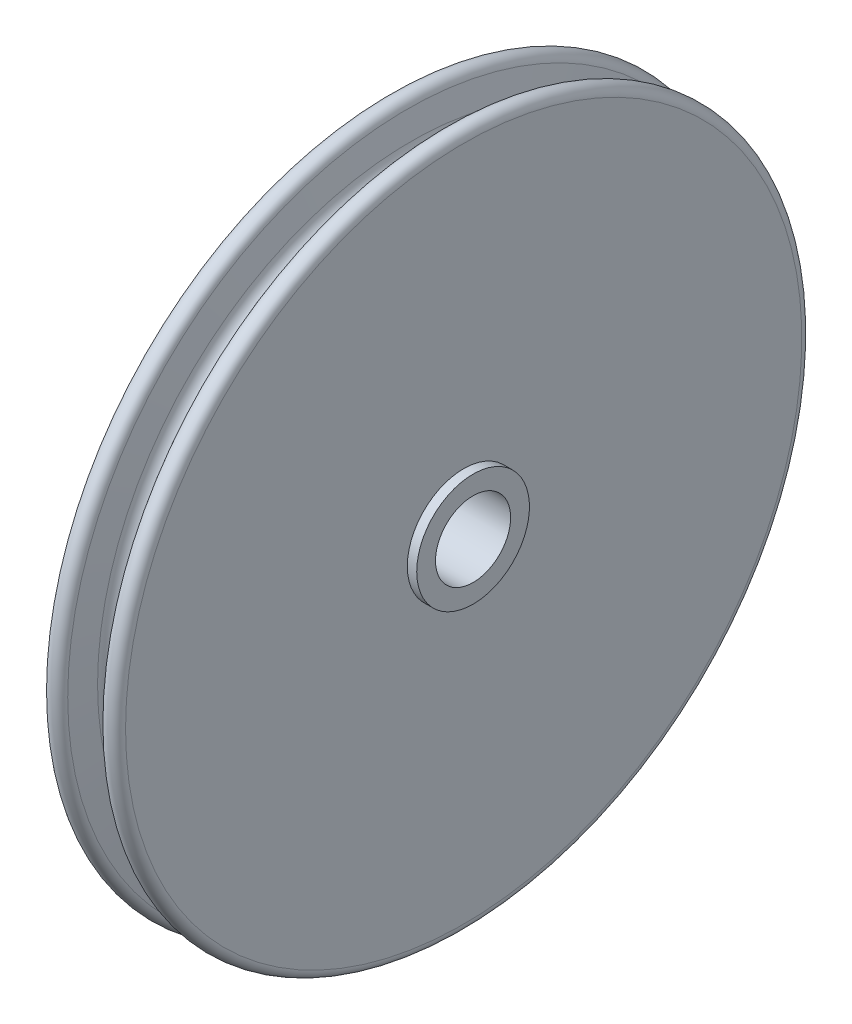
ISO-10303-21;
HEADER;
FILE_DESCRIPTION(('STEP AP214'),'2;1');
FILE_NAME('part.step','',(''),(''),'','','');
FILE_SCHEMA(('AUTOMOTIVE_DESIGN { 1 0 10303 214 1 1 1 1 }'));
ENDSEC;
DATA;
#1=APPLICATION_CONTEXT('core data for automotive mechanical design processes');
#2=APPLICATION_PROTOCOL_DEFINITION('international standard','automotive_design',2000,#1);
#3=PRODUCT_CONTEXT('',#1,'mechanical');
#4=PRODUCT('Part','Part','',(#3));
#5=PRODUCT_RELATED_PRODUCT_CATEGORY('part','',(#4));
#6=PRODUCT_DEFINITION_FORMATION('','',#4);
#7=PRODUCT_DEFINITION_CONTEXT('part definition',#1,'design');
#8=PRODUCT_DEFINITION('design','',#6,#7);
#9=PRODUCT_DEFINITION_SHAPE('','',#8);
#10=(LENGTH_UNIT() NAMED_UNIT(*) SI_UNIT(.MILLI.,.METRE.));
#11=(NAMED_UNIT(*) PLANE_ANGLE_UNIT() SI_UNIT($,.RADIAN.));
#12=(NAMED_UNIT(*) SI_UNIT($,.STERADIAN.) SOLID_ANGLE_UNIT());
#13=UNCERTAINTY_MEASURE_WITH_UNIT(LENGTH_MEASURE(1.E-05),#10,'distance_accuracy_value','');
#14=(GEOMETRIC_REPRESENTATION_CONTEXT(3) GLOBAL_UNCERTAINTY_ASSIGNED_CONTEXT((#13)) GLOBAL_UNIT_ASSIGNED_CONTEXT((#10,
#11,#12)) REPRESENTATION_CONTEXT('',''));
#15=CARTESIAN_POINT('',(0.,0.,0.));
#16=DIRECTION('',(0.,0.,1.));
#17=DIRECTION('',(1.,0.,0.));
#18=AXIS2_PLACEMENT_3D('',#15,#16,#17);
#19=CARTESIAN_POINT('',(0.,0.,0.));
#20=DIRECTION('',(-1.,0.,0.));
#21=DIRECTION('',(0.,0.,1.));
#22=AXIS2_PLACEMENT_3D('',#19,#20,#21);
#23=TOROIDAL_SURFACE('',#22,84.0438552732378,4.04385527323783);
#24=CARTESIAN_POINT('',(-4.,0.,0.));
#25=DIRECTION('',(-1.,0.,0.));
#26=DIRECTION('',(0.,0.,1.));
#27=AXIS2_PLACEMENT_3D('',#24,#25,#26);
#28=CIRCLE('',#27,83.4499146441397);
#29=CARTESIAN_POINT('',(-4.,0.,83.4499146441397));
#30=VERTEX_POINT('',#29);
#31=EDGE_CURVE('E10',#30,#30,#28,.T.);
#32=ORIENTED_EDGE('',*,*,#31,.F.);
#33=EDGE_LOOP('',(#32));
#34=FACE_BOUND('',#33,.T.);
#35=CARTESIAN_POINT('',(4.,0.,0.));
#36=DIRECTION('',(-1.,0.,0.));
#37=DIRECTION('',(0.,0.,1.));
#38=AXIS2_PLACEMENT_3D('',#35,#36,#37);
#39=CIRCLE('',#38,83.4499146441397);
#40=CARTESIAN_POINT('',(4.,0.,83.4499146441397));
#41=VERTEX_POINT('',#40);
#42=EDGE_CURVE('E69',#41,#41,#39,.T.);
#43=ORIENTED_EDGE('',*,*,#42,.T.);
#44=EDGE_LOOP('',(#43));
#45=FACE_BOUND('',#44,.T.);
#46=ADVANCED_FACE('F29',(#34,#45),#23,.F.);
#47=CARTESIAN_POINT('',(-4.,0.,0.));
#48=DIRECTION('',(-1.,0.,0.));
#49=DIRECTION('',(0.,0.,1.));
#50=AXIS2_PLACEMENT_3D('',#47,#48,#49);
#51=CONICAL_SURFACE('',#50,83.4499146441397,1.42338821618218);
#52=CARTESIAN_POINT('',(-5.02711229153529,0.,0.));
#53=DIRECTION('',(-1.,0.,0.));
#54=DIRECTION('',(0.,0.,1.));
#55=AXIS2_PLACEMENT_3D('',#52,#53,#54);
#56=CIRCLE('',#55,90.3671871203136);
#57=CARTESIAN_POINT('',(-5.02711229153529,0.,90.3671871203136));
#58=VERTEX_POINT('',#57);
#59=EDGE_CURVE('E35',#58,#58,#56,.T.);
#60=ORIENTED_EDGE('',*,*,#59,.F.);
#61=EDGE_LOOP('',(#60));
#62=FACE_BOUND('',#61,.T.);
#63=ORIENTED_EDGE('',*,*,#31,.T.);
#64=EDGE_LOOP('',(#63));
#65=FACE_BOUND('',#64,.T.);
#66=ADVANCED_FACE('F130',(#62,#65),#51,.T.);
#67=CARTESIAN_POINT('',(-7.5,0.,0.));
#68=DIRECTION('',(-1.,0.,0.));
#69=DIRECTION('',(0.,0.,1.));
#70=AXIS2_PLACEMENT_3D('',#67,#68,#69);
#71=TOROIDAL_SURFACE('',#70,90.,2.5);
#72=CARTESIAN_POINT('',(-10.,0.,0.));
#73=DIRECTION('',(-1.,0.,0.));
#74=DIRECTION('',(0.,0.,1.));
#75=AXIS2_PLACEMENT_3D('',#72,#73,#74);
#76=CIRCLE('',#75,90.);
#77=CARTESIAN_POINT('',(-10.,0.,90.));
#78=VERTEX_POINT('',#77);
#79=EDGE_CURVE('E39',#78,#78,#76,.T.);
#80=ORIENTED_EDGE('',*,*,#79,.F.);
#81=EDGE_LOOP('',(#80));
#82=FACE_BOUND('',#81,.T.);
#83=ORIENTED_EDGE('',*,*,#59,.T.);
#84=EDGE_LOOP('',(#83));
#85=FACE_BOUND('',#84,.T.);
#86=ADVANCED_FACE('F125',(#82,#85),#71,.T.);
#87=CARTESIAN_POINT('',(-10.,0.,-15.));
#88=DIRECTION('',(1.,0.,0.));
#89=DIRECTION('',(0.,0.,-1.));
#90=AXIS2_PLACEMENT_3D('',#87,#88,#89);
#91=PLANE('',#90);
#92=CARTESIAN_POINT('',(-10.,0.,0.));
#93=DIRECTION('',(-1.,0.,0.));
#94=DIRECTION('',(0.,0.,1.));
#95=AXIS2_PLACEMENT_3D('',#92,#93,#94);
#96=CIRCLE('',#95,15.);
#97=CARTESIAN_POINT('',(-10.,0.,15.));
#98=VERTEX_POINT('',#97);
#99=EDGE_CURVE('E43',#98,#98,#96,.T.);
#100=ORIENTED_EDGE('',*,*,#99,.F.);
#101=EDGE_LOOP('',(#100));
#102=FACE_BOUND('',#101,.T.);
#103=ORIENTED_EDGE('',*,*,#79,.T.);
#104=EDGE_LOOP('',(#103));
#105=FACE_BOUND('',#104,.T.);
#106=ADVANCED_FACE('F119',(#102,#105),#91,.F.);
#107=CARTESIAN_POINT('',(-12.5,0.,0.));
#108=DIRECTION('',(-1.,0.,0.));
#109=DIRECTION('',(0.,0.,1.));
#110=AXIS2_PLACEMENT_3D('',#107,#108,#109);
#111=CYLINDRICAL_SURFACE('',#110,15.);
#112=CARTESIAN_POINT('',(-12.5,0.,0.));
#113=DIRECTION('',(-1.,0.,0.));
#114=DIRECTION('',(0.,0.,1.));
#115=AXIS2_PLACEMENT_3D('',#112,#113,#114);
#116=CIRCLE('',#115,15.);
#117=CARTESIAN_POINT('',(-12.5,0.,15.));
#118=VERTEX_POINT('',#117);
#119=EDGE_CURVE('E48',#118,#118,#116,.T.);
#120=ORIENTED_EDGE('',*,*,#119,.F.);
#121=EDGE_LOOP('',(#120));
#122=FACE_BOUND('',#121,.T.);
#123=ORIENTED_EDGE('',*,*,#99,.T.);
#124=EDGE_LOOP('',(#123));
#125=FACE_BOUND('',#124,.T.);
#126=ADVANCED_FACE('F113',(#122,#125),#111,.T.);
#127=CARTESIAN_POINT('',(-12.5,0.,-10.));
#128=DIRECTION('',(1.,0.,0.));
#129=DIRECTION('',(0.,0.,-1.));
#130=AXIS2_PLACEMENT_3D('',#127,#128,#129);
#131=PLANE('',#130);
#132=CARTESIAN_POINT('',(-12.5,0.,0.));
#133=DIRECTION('',(-1.,0.,0.));
#134=DIRECTION('',(0.,0.,1.));
#135=AXIS2_PLACEMENT_3D('',#132,#133,#134);
#136=CIRCLE('',#135,10.);
#137=CARTESIAN_POINT('',(-12.5,0.,10.));
#138=VERTEX_POINT('',#137);
#139=EDGE_CURVE('E51',#138,#138,#136,.T.);
#140=ORIENTED_EDGE('',*,*,#139,.F.);
#141=EDGE_LOOP('',(#140));
#142=FACE_BOUND('',#141,.T.);
#143=ORIENTED_EDGE('',*,*,#119,.T.);
#144=EDGE_LOOP('',(#143));
#145=FACE_BOUND('',#144,.T.);
#146=ADVANCED_FACE('F107',(#142,#145),#131,.F.);
#147=CARTESIAN_POINT('',(-12.5,0.,0.));
#148=DIRECTION('',(-1.,0.,0.));
#149=DIRECTION('',(0.,0.,1.));
#150=AXIS2_PLACEMENT_3D('',#147,#148,#149);
#151=CYLINDRICAL_SURFACE('',#150,10.);
#152=CARTESIAN_POINT('',(12.5,0.,0.));
#153=DIRECTION('',(-1.,0.,0.));
#154=DIRECTION('',(0.,0.,1.));
#155=AXIS2_PLACEMENT_3D('',#152,#153,#154);
#156=CIRCLE('',#155,10.);
#157=CARTESIAN_POINT('',(12.5,0.,10.));
#158=VERTEX_POINT('',#157);
#159=EDGE_CURVE('E54',#158,#158,#156,.T.);
#160=ORIENTED_EDGE('',*,*,#159,.F.);
#161=EDGE_LOOP('',(#160));
#162=FACE_BOUND('',#161,.T.);
#163=ORIENTED_EDGE('',*,*,#139,.T.);
#164=EDGE_LOOP('',(#163));
#165=FACE_BOUND('',#164,.T.);
#166=ADVANCED_FACE('F101',(#162,#165),#151,.F.);
#167=CARTESIAN_POINT('',(12.5,0.,-10.));
#168=DIRECTION('',(-1.,0.,0.));
#169=DIRECTION('',(0.,0.,1.));
#170=AXIS2_PLACEMENT_3D('',#167,#168,#169);
#171=PLANE('',#170);
#172=CARTESIAN_POINT('',(12.5,0.,0.));
#173=DIRECTION('',(-1.,0.,0.));
#174=DIRECTION('',(0.,0.,1.));
#175=AXIS2_PLACEMENT_3D('',#172,#173,#174);
#176=CIRCLE('',#175,15.);
#177=CARTESIAN_POINT('',(12.5,0.,15.));
#178=VERTEX_POINT('',#177);
#179=EDGE_CURVE('E57',#178,#178,#176,.T.);
#180=ORIENTED_EDGE('',*,*,#179,.F.);
#181=EDGE_LOOP('',(#180));
#182=FACE_BOUND('',#181,.T.);
#183=ORIENTED_EDGE('',*,*,#159,.T.);
#184=EDGE_LOOP('',(#183));
#185=FACE_BOUND('',#184,.T.);
#186=ADVANCED_FACE('F95',(#182,#185),#171,.F.);
#187=CARTESIAN_POINT('',(-12.5,0.,0.));
#188=DIRECTION('',(-1.,0.,0.));
#189=DIRECTION('',(0.,0.,1.));
#190=AXIS2_PLACEMENT_3D('',#187,#188,#189);
#191=CYLINDRICAL_SURFACE('',#190,15.);
#192=CARTESIAN_POINT('',(10.,0.,0.));
#193=DIRECTION('',(-1.,0.,0.));
#194=DIRECTION('',(0.,0.,1.));
#195=AXIS2_PLACEMENT_3D('',#192,#193,#194);
#196=CIRCLE('',#195,15.);
#197=CARTESIAN_POINT('',(10.,0.,15.));
#198=VERTEX_POINT('',#197);
#199=EDGE_CURVE('E60',#198,#198,#196,.T.);
#200=ORIENTED_EDGE('',*,*,#199,.F.);
#201=EDGE_LOOP('',(#200));
#202=FACE_BOUND('',#201,.T.);
#203=ORIENTED_EDGE('',*,*,#179,.T.);
#204=EDGE_LOOP('',(#203));
#205=FACE_BOUND('',#204,.T.);
#206=ADVANCED_FACE('F89',(#202,#205),#191,.T.);
#207=CARTESIAN_POINT('',(9.99999999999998,0.,-15.));
#208=DIRECTION('',(-1.,0.,0.));
#209=DIRECTION('',(0.,0.,1.));
#210=AXIS2_PLACEMENT_3D('',#207,#208,#209);
#211=PLANE('',#210);
#212=CARTESIAN_POINT('',(9.99999999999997,0.,0.));
#213=DIRECTION('',(-1.,0.,0.));
#214=DIRECTION('',(0.,0.,1.));
#215=AXIS2_PLACEMENT_3D('',#212,#213,#214);
#216=CIRCLE('',#215,90.);
#217=CARTESIAN_POINT('',(9.99999999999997,0.,90.));
#218=VERTEX_POINT('',#217);
#219=EDGE_CURVE('E63',#218,#218,#216,.T.);
#220=ORIENTED_EDGE('',*,*,#219,.F.);
#221=EDGE_LOOP('',(#220));
#222=FACE_BOUND('',#221,.T.);
#223=ORIENTED_EDGE('',*,*,#199,.T.);
#224=EDGE_LOOP('',(#223));
#225=FACE_BOUND('',#224,.T.);
#226=ADVANCED_FACE('F83',(#222,#225),#211,.F.);
#227=CARTESIAN_POINT('',(7.5,0.,0.));
#228=DIRECTION('',(-1.,0.,0.));
#229=DIRECTION('',(0.,0.,1.));
#230=AXIS2_PLACEMENT_3D('',#227,#228,#229);
#231=TOROIDAL_SURFACE('',#230,90.,2.49999999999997);
#232=CARTESIAN_POINT('',(5.02711229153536,0.,0.));
#233=DIRECTION('',(-1.,0.,0.));
#234=DIRECTION('',(0.,0.,1.));
#235=AXIS2_PLACEMENT_3D('',#232,#233,#234);
#236=CIRCLE('',#235,90.3671871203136);
#237=CARTESIAN_POINT('',(5.02711229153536,0.,90.3671871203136));
#238=VERTEX_POINT('',#237);
#239=EDGE_CURVE('E66',#238,#238,#236,.T.);
#240=ORIENTED_EDGE('',*,*,#239,.F.);
#241=EDGE_LOOP('',(#240));
#242=FACE_BOUND('',#241,.T.);
#243=ORIENTED_EDGE('',*,*,#219,.T.);
#244=EDGE_LOOP('',(#243));
#245=FACE_BOUND('',#244,.T.);
#246=ADVANCED_FACE('F77',(#242,#245),#231,.T.);
#247=CARTESIAN_POINT('',(5.02711229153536,0.,0.));
#248=DIRECTION('',(1.,0.,0.));
#249=DIRECTION('',(0.,0.,-1.));
#250=AXIS2_PLACEMENT_3D('',#247,#248,#249);
#251=CONICAL_SURFACE('',#250,90.3671871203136,1.42338821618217);
#252=ORIENTED_EDGE('',*,*,#42,.F.);
#253=EDGE_LOOP('',(#252));
#254=FACE_BOUND('',#253,.T.);
#255=ORIENTED_EDGE('',*,*,#239,.T.);
#256=EDGE_LOOP('',(#255));
#257=FACE_BOUND('',#256,.T.);
#258=ADVANCED_FACE('F74',(#254,#257),#251,.T.);
#259=CLOSED_SHELL('',(#46,#66,#86,#106,#126,#146,#166,#186,#206,#226,#246,#258));
#260=MANIFOLD_SOLID_BREP('B2',#259);
#261=ADVANCED_BREP_SHAPE_REPRESENTATION('',(#18,#260),#14);
#262=SHAPE_DEFINITION_REPRESENTATION(#9,#261);
ENDSEC;
END-ISO-10303-21;
